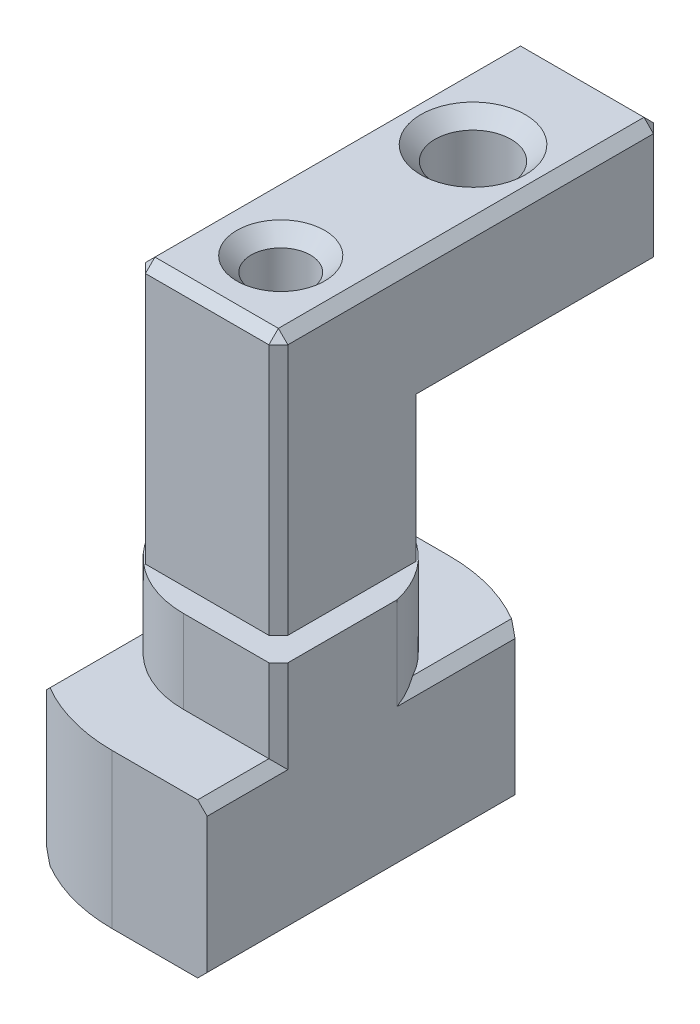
ISO-10303-21;
HEADER;
FILE_DESCRIPTION(('STEP AP214'),'2;1');
FILE_NAME('part.step','',(''),(''),'','','');
FILE_SCHEMA(('AUTOMOTIVE_DESIGN { 1 0 10303 214 1 1 1 1 }'));
ENDSEC;
DATA;
#1=APPLICATION_CONTEXT('core data for automotive mechanical design processes');
#2=APPLICATION_PROTOCOL_DEFINITION('international standard','automotive_design',2000,#1);
#3=PRODUCT_CONTEXT('',#1,'mechanical');
#4=PRODUCT('Part','Part','',(#3));
#5=PRODUCT_RELATED_PRODUCT_CATEGORY('part','',(#4));
#6=PRODUCT_DEFINITION_FORMATION('','',#4);
#7=PRODUCT_DEFINITION_CONTEXT('part definition',#1,'design');
#8=PRODUCT_DEFINITION('design','',#6,#7);
#9=PRODUCT_DEFINITION_SHAPE('','',#8);
#10=(LENGTH_UNIT() NAMED_UNIT(*) SI_UNIT(.MILLI.,.METRE.));
#11=(NAMED_UNIT(*) PLANE_ANGLE_UNIT() SI_UNIT($,.RADIAN.));
#12=(NAMED_UNIT(*) SI_UNIT($,.STERADIAN.) SOLID_ANGLE_UNIT());
#13=UNCERTAINTY_MEASURE_WITH_UNIT(LENGTH_MEASURE(1.E-05),#10,'distance_accuracy_value','');
#14=(GEOMETRIC_REPRESENTATION_CONTEXT(3) GLOBAL_UNCERTAINTY_ASSIGNED_CONTEXT((#13)) GLOBAL_UNIT_ASSIGNED_CONTEXT((#10,
#11,#12)) REPRESENTATION_CONTEXT('',''));
#15=CARTESIAN_POINT('',(0.,0.,0.));
#16=DIRECTION('',(0.,0.,1.));
#17=DIRECTION('',(1.,0.,0.));
#18=AXIS2_PLACEMENT_3D('',#15,#16,#17);
#19=CARTESIAN_POINT('',(0.,10.,0.));
#20=DIRECTION('',(0.,-1.,0.));
#21=DIRECTION('',(0.,0.,-1.));
#22=AXIS2_PLACEMENT_3D('',#19,#20,#21);
#23=PLANE('',#22);
#24=CARTESIAN_POINT('',(0.,10.,0.));
#25=DIRECTION('',(0.,1.,0.));
#26=DIRECTION('',(0.,0.,-1.));
#27=AXIS2_PLACEMENT_3D('',#24,#25,#26);
#28=CIRCLE('',#27,4.1);
#29=CARTESIAN_POINT('',(-4.,10.,0.900000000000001));
#30=VERTEX_POINT('',#29);
#31=CARTESIAN_POINT('',(0.,10.,4.1));
#32=VERTEX_POINT('',#31);
#33=EDGE_CURVE('E417',#30,#32,#28,.T.);
#34=ORIENTED_EDGE('',*,*,#33,.T.);
#35=DIRECTION('',(1.,0.,0.));
#36=VECTOR('',#35,1.);
#37=CARTESIAN_POINT('',(4.,10.,4.1));
#38=LINE('',#37,#36);
#39=CARTESIAN_POINT('',(3.60000000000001,10.,4.1));
#40=VERTEX_POINT('',#39);
#41=EDGE_CURVE('E420',#32,#40,#38,.T.);
#42=ORIENTED_EDGE('',*,*,#41,.T.);
#43=DIRECTION('',(-0.707106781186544,0.,0.707106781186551));
#44=VECTOR('',#43,1.);
#45=CARTESIAN_POINT('',(4.,10.,3.7));
#46=LINE('',#45,#44);
#47=CARTESIAN_POINT('',(4.,10.,3.7));
#48=VERTEX_POINT('',#47);
#49=EDGE_CURVE('E270',#40,#48,#46,.F.);
#50=ORIENTED_EDGE('',*,*,#49,.T.);
#51=DIRECTION('',(0.,0.,-1.));
#52=VECTOR('',#51,1.);
#53=CARTESIAN_POINT('',(4.,10.,-0.899999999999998));
#54=LINE('',#53,#52);
#55=CARTESIAN_POINT('',(4.,10.,-0.899999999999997));
#56=VERTEX_POINT('',#55);
#57=EDGE_CURVE('E424',#48,#56,#54,.T.);
#58=ORIENTED_EDGE('',*,*,#57,.T.);
#59=CARTESIAN_POINT('',(0.,10.,0.));
#60=DIRECTION('',(0.,1.,0.));
#61=DIRECTION('',(0.,0.,-1.));
#62=AXIS2_PLACEMENT_3D('',#59,#60,#61);
#63=CIRCLE('',#62,4.1);
#64=CARTESIAN_POINT('',(0.,10.,-4.1));
#65=VERTEX_POINT('',#64);
#66=EDGE_CURVE('E427',#56,#65,#63,.T.);
#67=ORIENTED_EDGE('',*,*,#66,.T.);
#68=DIRECTION('',(-1.,0.,0.));
#69=VECTOR('',#68,1.);
#70=CARTESIAN_POINT('',(-4.,10.,-4.1));
#71=LINE('',#70,#69);
#72=CARTESIAN_POINT('',(-3.60000000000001,10.,-4.1));
#73=VERTEX_POINT('',#72);
#74=EDGE_CURVE('E430',#65,#73,#71,.T.);
#75=ORIENTED_EDGE('',*,*,#74,.T.);
#76=DIRECTION('',(0.707106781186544,0.,-0.707106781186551));
#77=VECTOR('',#76,1.);
#78=CARTESIAN_POINT('',(-4.,10.,-3.7));
#79=LINE('',#78,#77);
#80=CARTESIAN_POINT('',(-4.,10.,-3.7));
#81=VERTEX_POINT('',#80);
#82=EDGE_CURVE('E279',#73,#81,#79,.F.);
#83=ORIENTED_EDGE('',*,*,#82,.T.);
#84=DIRECTION('',(0.,0.,1.));
#85=VECTOR('',#84,1.);
#86=CARTESIAN_POINT('',(-4.,10.,0.900000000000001));
#87=LINE('',#86,#85);
#88=EDGE_CURVE('E433',#81,#30,#87,.T.);
#89=ORIENTED_EDGE('',*,*,#88,.T.);
#90=EDGE_LOOP('',(#34,#42,#50,#58,#67,#75,#83,#89));
#91=FACE_BOUND('',#90,.T.);
#92=DIRECTION('',(1.,0.,0.));
#93=VECTOR('',#92,1.);
#94=CARTESIAN_POINT('',(3.,10.,3.1));
#95=LINE('',#94,#93);
#96=CARTESIAN_POINT('',(-2.6,10.,3.1));
#97=VERTEX_POINT('',#96);
#98=CARTESIAN_POINT('',(2.6,10.,3.1));
#99=VERTEX_POINT('',#98);
#100=EDGE_CURVE('E408',#97,#99,#95,.T.);
#101=ORIENTED_EDGE('',*,*,#100,.F.);
#102=DIRECTION('',(0.707106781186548,0.,0.707106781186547));
#103=VECTOR('',#102,1.);
#104=CARTESIAN_POINT('',(-2.85,10.,2.85));
#105=LINE('',#104,#103);
#106=CARTESIAN_POINT('',(-3.,10.,2.7));
#107=VERTEX_POINT('',#106);
#108=EDGE_CURVE('E287',#97,#107,#105,.F.);
#109=ORIENTED_EDGE('',*,*,#108,.T.);
#110=DIRECTION('',(0.,0.,1.));
#111=VECTOR('',#110,1.);
#112=CARTESIAN_POINT('',(-3.,10.,3.1));
#113=LINE('',#112,#111);
#114=CARTESIAN_POINT('',(-3.,10.,-2.7));
#115=VERTEX_POINT('',#114);
#116=EDGE_CURVE('E394',#115,#107,#113,.T.);
#117=ORIENTED_EDGE('',*,*,#116,.F.);
#118=DIRECTION('',(-0.707106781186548,0.,0.707106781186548));
#119=VECTOR('',#118,1.);
#120=CARTESIAN_POINT('',(-2.85,10.,-2.85));
#121=LINE('',#120,#119);
#122=CARTESIAN_POINT('',(-2.6,10.,-3.1));
#123=VERTEX_POINT('',#122);
#124=EDGE_CURVE('E291',#115,#123,#121,.F.);
#125=ORIENTED_EDGE('',*,*,#124,.T.);
#126=DIRECTION('',(-1.,0.,0.));
#127=VECTOR('',#126,1.);
#128=CARTESIAN_POINT('',(-3.,10.,-3.1));
#129=LINE('',#128,#127);
#130=CARTESIAN_POINT('',(2.6,10.,-3.1));
#131=VERTEX_POINT('',#130);
#132=EDGE_CURVE('E411',#131,#123,#129,.T.);
#133=ORIENTED_EDGE('',*,*,#132,.F.);
#134=DIRECTION('',(-0.707106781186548,0.,-0.707106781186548));
#135=VECTOR('',#134,1.);
#136=CARTESIAN_POINT('',(2.85,10.,-2.85));
#137=LINE('',#136,#135);
#138=CARTESIAN_POINT('',(3.,10.,-2.7));
#139=VERTEX_POINT('',#138);
#140=EDGE_CURVE('E69',#131,#139,#137,.F.);
#141=ORIENTED_EDGE('',*,*,#140,.T.);
#142=DIRECTION('',(0.,0.,-1.));
#143=VECTOR('',#142,1.);
#144=CARTESIAN_POINT('',(3.,10.,-3.1));
#145=LINE('',#144,#143);
#146=CARTESIAN_POINT('',(3.,10.,2.7));
#147=VERTEX_POINT('',#146);
#148=EDGE_CURVE('E398',#147,#139,#145,.T.);
#149=ORIENTED_EDGE('',*,*,#148,.F.);
#150=DIRECTION('',(0.707106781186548,0.,-0.707106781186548));
#151=VECTOR('',#150,1.);
#152=CARTESIAN_POINT('',(2.85,10.,2.85));
#153=LINE('',#152,#151);
#154=EDGE_CURVE('E289',#147,#99,#153,.F.);
#155=ORIENTED_EDGE('',*,*,#154,.T.);
#156=EDGE_LOOP('',(#101,#109,#117,#125,#133,#141,#149,#155));
#157=FACE_BOUND('',#156,.T.);
#158=ADVANCED_FACE('F37',(#91,#157),#23,.F.);
#159=CARTESIAN_POINT('',(0.,6.5,0.));
#160=DIRECTION('',(0.,1.,0.));
#161=DIRECTION('',(0.,0.,1.));
#162=AXIS2_PLACEMENT_3D('',#159,#160,#161);
#163=PLANE('',#162);
#164=CARTESIAN_POINT('',(0.,6.5,0.));
#165=DIRECTION('',(0.,1.,0.));
#166=DIRECTION('',(0.,0.,-1.));
#167=AXIS2_PLACEMENT_3D('',#164,#165,#166);
#168=CIRCLE('',#167,4.1);
#169=CARTESIAN_POINT('',(3.60000000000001,6.5,-1.96214168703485));
#170=VERTEX_POINT('',#169);
#171=CARTESIAN_POINT('',(0.,6.5,-4.1));
#172=VERTEX_POINT('',#171);
#173=EDGE_CURVE('E81',#170,#172,#168,.T.);
#174=ORIENTED_EDGE('',*,*,#173,.F.);
#175=DIRECTION('',(0.,0.,-1.));
#176=VECTOR('',#175,1.);
#177=CARTESIAN_POINT('',(3.60000000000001,6.5,-5.86600375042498));
#178=LINE('',#177,#176);
#179=CARTESIAN_POINT('',(3.60000000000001,6.5,-6.11964051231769));
#180=VERTEX_POINT('',#179);
#181=EDGE_CURVE('E561',#170,#180,#178,.T.);
#182=ORIENTED_EDGE('',*,*,#181,.T.);
#183=CARTESIAN_POINT('',(0.,6.5,0.));
#184=DIRECTION('',(0.,1.,0.));
#185=DIRECTION('',(0.,0.,1.));
#186=AXIS2_PLACEMENT_3D('',#183,#184,#185);
#187=CIRCLE('',#186,7.1);
#188=CARTESIAN_POINT('',(0.,6.5,-7.1));
#189=VERTEX_POINT('',#188);
#190=EDGE_CURVE('E460',#180,#189,#187,.T.);
#191=ORIENTED_EDGE('',*,*,#190,.T.);
#192=DIRECTION('',(-1.,0.,0.));
#193=VECTOR('',#192,1.);
#194=CARTESIAN_POINT('',(0.,6.5,-7.1));
#195=LINE('',#194,#193);
#196=CARTESIAN_POINT('',(-3.60000000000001,6.5,-7.1));
#197=VERTEX_POINT('',#196);
#198=EDGE_CURVE('E463',#189,#197,#195,.T.);
#199=ORIENTED_EDGE('',*,*,#198,.T.);
#200=DIRECTION('',(0.,0.,1.));
#201=VECTOR('',#200,1.);
#202=CARTESIAN_POINT('',(-3.60000000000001,6.5,-4.1));
#203=LINE('',#202,#201);
#204=CARTESIAN_POINT('',(-3.60000000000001,6.5,-4.1));
#205=VERTEX_POINT('',#204);
#206=EDGE_CURVE('E559',#197,#205,#203,.T.);
#207=ORIENTED_EDGE('',*,*,#206,.T.);
#208=DIRECTION('',(-1.,0.,0.));
#209=VECTOR('',#208,1.);
#210=CARTESIAN_POINT('',(-4.,6.5,-4.1));
#211=LINE('',#210,#209);
#212=EDGE_CURVE('E421',#172,#205,#211,.T.);
#213=ORIENTED_EDGE('',*,*,#212,.F.);
#214=EDGE_LOOP('',(#174,#182,#191,#199,#207,#213));
#215=FACE_BOUND('',#214,.T.);
#216=ADVANCED_FACE('F622',(#215),#163,.T.);
#217=CARTESIAN_POINT('',(0.,6.5,0.));
#218=DIRECTION('',(0.,-1.,0.));
#219=DIRECTION('',(0.,0.,-1.));
#220=AXIS2_PLACEMENT_3D('',#217,#218,#219);
#221=CYLINDRICAL_SURFACE('',#220,7.1);
#222=CARTESIAN_POINT('',(0.,6.5,0.));
#223=DIRECTION('',(0.,1.,0.));
#224=DIRECTION('',(0.,0.,1.));
#225=AXIS2_PLACEMENT_3D('',#222,#223,#224);
#226=CIRCLE('',#225,7.1);
#227=CARTESIAN_POINT('',(-3.6,6.5,6.11964051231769));
#228=VERTEX_POINT('',#227);
#229=CARTESIAN_POINT('',(0.,6.5,7.1));
#230=VERTEX_POINT('',#229);
#231=EDGE_CURVE('E453',#228,#230,#226,.T.);
#232=ORIENTED_EDGE('',*,*,#231,.F.);
#233=CARTESIAN_POINT('',(0.,10.1,0.));
#234=DIRECTION('',(-0.707106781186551,0.707106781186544,0.));
#235=DIRECTION('',(-0.707106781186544,-0.707106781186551,0.));
#236=AXIS2_PLACEMENT_3D('',#233,#234,#235);
#237=ELLIPSE('',#236,10.040916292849,7.1);
#238=CARTESIAN_POINT('',(-4.,6.1,5.86600375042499));
#239=VERTEX_POINT('',#238);
#240=EDGE_CURVE('E546',#228,#239,#237,.F.);
#241=ORIENTED_EDGE('',*,*,#240,.T.);
#242=DIRECTION('',(0.,-1.,0.));
#243=VECTOR('',#242,1.);
#244=CARTESIAN_POINT('',(-4.,6.5,5.86600375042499));
#245=LINE('',#244,#243);
#246=CARTESIAN_POINT('',(-4.,0.400000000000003,5.86600375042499));
#247=VERTEX_POINT('',#246);
#248=EDGE_CURVE('E466',#239,#247,#245,.T.);
#249=ORIENTED_EDGE('',*,*,#248,.T.);
#250=CARTESIAN_POINT('',(0.,-3.6,0.));
#251=DIRECTION('',(0.707106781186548,0.707106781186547,0.));
#252=DIRECTION('',(0.707106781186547,-0.707106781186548,0.));
#253=AXIS2_PLACEMENT_3D('',#250,#251,#252);
#254=ELLIPSE('',#253,10.040916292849,7.1);
#255=CARTESIAN_POINT('',(-3.6,0.,6.1196405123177));
#256=VERTEX_POINT('',#255);
#257=EDGE_CURVE('E544',#247,#256,#254,.T.);
#258=ORIENTED_EDGE('',*,*,#257,.T.);
#259=CARTESIAN_POINT('',(0.,0.,0.));
#260=DIRECTION('',(0.,1.,0.));
#261=DIRECTION('',(0.,0.,1.));
#262=AXIS2_PLACEMENT_3D('',#259,#260,#261);
#263=CIRCLE('',#262,7.1);
#264=CARTESIAN_POINT('',(0.,0.,7.1));
#265=VERTEX_POINT('',#264);
#266=EDGE_CURVE('E263',#256,#265,#263,.T.);
#267=ORIENTED_EDGE('',*,*,#266,.T.);
#268=DIRECTION('',(0.,-1.,0.));
#269=VECTOR('',#268,1.);
#270=CARTESIAN_POINT('',(0.,6.5,7.1));
#271=LINE('',#270,#269);
#272=EDGE_CURVE('E262',#230,#265,#271,.T.);
#273=ORIENTED_EDGE('',*,*,#272,.F.);
#274=EDGE_LOOP('',(#232,#241,#249,#258,#267,#273));
#275=FACE_BOUND('',#274,.T.);
#276=ADVANCED_FACE('F672',(#275),#221,.T.);
#277=CARTESIAN_POINT('',(0.,6.5,7.1));
#278=DIRECTION('',(0.,0.,-1.));
#279=DIRECTION('',(-1.,0.,0.));
#280=AXIS2_PLACEMENT_3D('',#277,#278,#279);
#281=PLANE('',#280);
#282=DIRECTION('',(0.,-1.,0.));
#283=VECTOR('',#282,1.);
#284=CARTESIAN_POINT('',(4.,6.5,7.1));
#285=LINE('',#284,#283);
#286=CARTESIAN_POINT('',(4.,6.1,7.1));
#287=VERTEX_POINT('',#286);
#288=CARTESIAN_POINT('',(4.,0.400000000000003,7.1));
#289=VERTEX_POINT('',#288);
#290=EDGE_CURVE('E482',#287,#289,#285,.T.);
#291=ORIENTED_EDGE('',*,*,#290,.F.);
#292=DIRECTION('',(-0.707106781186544,0.707106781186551,0.));
#293=VECTOR('',#292,1.);
#294=CARTESIAN_POINT('',(3.60000000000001,6.5,7.1));
#295=LINE('',#294,#293);
#296=CARTESIAN_POINT('',(3.60000000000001,6.5,7.1));
#297=VERTEX_POINT('',#296);
#298=EDGE_CURVE('E269',#287,#297,#295,.T.);
#299=ORIENTED_EDGE('',*,*,#298,.T.);
#300=DIRECTION('',(1.,0.,0.));
#301=VECTOR('',#300,1.);
#302=CARTESIAN_POINT('',(0.,6.5,7.1));
#303=LINE('',#302,#301);
#304=EDGE_CURVE('E456',#230,#297,#303,.T.);
#305=ORIENTED_EDGE('',*,*,#304,.F.);
#306=ORIENTED_EDGE('',*,*,#272,.T.);
#307=DIRECTION('',(1.,0.,0.));
#308=VECTOR('',#307,1.);
#309=CARTESIAN_POINT('',(0.,0.,7.1));
#310=LINE('',#309,#308);
#311=CARTESIAN_POINT('',(3.6,0.,7.1));
#312=VERTEX_POINT('',#311);
#313=EDGE_CURVE('E248',#265,#312,#310,.T.);
#314=ORIENTED_EDGE('',*,*,#313,.T.);
#315=DIRECTION('',(-0.707106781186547,-0.707106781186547,0.));
#316=VECTOR('',#315,1.);
#317=CARTESIAN_POINT('',(4.,0.400000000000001,7.1));
#318=LINE('',#317,#316);
#319=EDGE_CURVE('E258',#312,#289,#318,.F.);
#320=ORIENTED_EDGE('',*,*,#319,.T.);
#321=EDGE_LOOP('',(#291,#299,#305,#306,#314,#320));
#322=FACE_BOUND('',#321,.T.);
#323=ADVANCED_FACE('F257',(#322),#281,.F.);
#324=CARTESIAN_POINT('',(4.,6.5,7.1));
#325=DIRECTION('',(-1.,0.,0.));
#326=DIRECTION('',(0.,0.,1.));
#327=AXIS2_PLACEMENT_3D('',#324,#325,#326);
#328=PLANE('',#327);
#329=DIRECTION('',(0.,-1.,0.));
#330=VECTOR('',#329,1.);
#331=CARTESIAN_POINT('',(4.,6.5,-5.86600375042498));
#332=LINE('',#331,#330);
#333=CARTESIAN_POINT('',(4.,6.1,-5.86600375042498));
#334=VERTEX_POINT('',#333);
#335=CARTESIAN_POINT('',(4.,0.400000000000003,-5.86600375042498));
#336=VERTEX_POINT('',#335);
#337=EDGE_CURVE('E479',#334,#336,#332,.T.);
#338=ORIENTED_EDGE('',*,*,#337,.F.);
#339=DIRECTION('',(0.,0.,1.));
#340=VECTOR('',#339,1.);
#341=CARTESIAN_POINT('',(4.,6.1,-0.899999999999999));
#342=LINE('',#341,#340);
#343=CARTESIAN_POINT('',(4.,6.1,-0.899999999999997));
#344=VERTEX_POINT('',#343);
#345=EDGE_CURVE('E574',#334,#344,#342,.T.);
#346=ORIENTED_EDGE('',*,*,#345,.T.);
#347=DIRECTION('',(0.,-1.,0.));
#348=VECTOR('',#347,1.);
#349=CARTESIAN_POINT('',(4.,10.,-0.899999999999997));
#350=LINE('',#349,#348);
#351=EDGE_CURVE('E448',#56,#344,#350,.T.);
#352=ORIENTED_EDGE('',*,*,#351,.F.);
#353=ORIENTED_EDGE('',*,*,#57,.F.);
#354=DIRECTION('',(0.,-1.,0.));
#355=VECTOR('',#354,1.);
#356=CARTESIAN_POINT('',(4.,6.5,3.7));
#357=LINE('',#356,#355);
#358=CARTESIAN_POINT('',(4.,6.1,3.7));
#359=VERTEX_POINT('',#358);
#360=EDGE_CURVE('E571',#48,#359,#357,.T.);
#361=ORIENTED_EDGE('',*,*,#360,.T.);
#362=DIRECTION('',(0.,0.,1.));
#363=VECTOR('',#362,1.);
#364=CARTESIAN_POINT('',(4.,6.1,7.1));
#365=LINE('',#364,#363);
#366=EDGE_CURVE('E569',#359,#287,#365,.T.);
#367=ORIENTED_EDGE('',*,*,#366,.T.);
#368=ORIENTED_EDGE('',*,*,#290,.T.);
#369=DIRECTION('',(0.,0.,-1.));
#370=VECTOR('',#369,1.);
#371=CARTESIAN_POINT('',(4.,0.400000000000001,7.1));
#372=LINE('',#371,#370);
#373=EDGE_CURVE('E268',#289,#336,#372,.T.);
#374=ORIENTED_EDGE('',*,*,#373,.T.);
#375=EDGE_LOOP('',(#338,#346,#352,#353,#361,#367,#368,#374));
#376=FACE_BOUND('',#375,.T.);
#377=ADVANCED_FACE('F595',(#376),#328,.F.);
#378=CARTESIAN_POINT('',(0.,6.5,0.));
#379=DIRECTION('',(0.,-1.,0.));
#380=DIRECTION('',(0.,0.,-1.));
#381=AXIS2_PLACEMENT_3D('',#378,#379,#380);
#382=CYLINDRICAL_SURFACE('',#381,7.1);
#383=ORIENTED_EDGE('',*,*,#190,.F.);
#384=CARTESIAN_POINT('',(0.,10.1,0.));
#385=DIRECTION('',(0.707106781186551,0.707106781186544,0.));
#386=DIRECTION('',(0.707106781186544,-0.707106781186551,0.));
#387=AXIS2_PLACEMENT_3D('',#384,#385,#386);
#388=ELLIPSE('',#387,10.040916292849,7.1);
#389=EDGE_CURVE('E566',#180,#334,#388,.F.);
#390=ORIENTED_EDGE('',*,*,#389,.T.);
#391=ORIENTED_EDGE('',*,*,#337,.T.);
#392=CARTESIAN_POINT('',(0.,-3.6,0.));
#393=DIRECTION('',(-0.707106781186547,0.707106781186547,0.));
#394=DIRECTION('',(-0.707106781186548,-0.707106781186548,0.));
#395=AXIS2_PLACEMENT_3D('',#392,#393,#394);
#396=ELLIPSE('',#395,10.040916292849,7.1);
#397=CARTESIAN_POINT('',(3.6,0.,-6.1196405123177));
#398=VERTEX_POINT('',#397);
#399=EDGE_CURVE('E564',#336,#398,#396,.T.);
#400=ORIENTED_EDGE('',*,*,#399,.T.);
#401=CARTESIAN_POINT('',(0.,0.,0.));
#402=DIRECTION('',(0.,1.,0.));
#403=DIRECTION('',(0.,0.,1.));
#404=AXIS2_PLACEMENT_3D('',#401,#402,#403);
#405=CIRCLE('',#404,7.1);
#406=CARTESIAN_POINT('',(0.,0.,-7.1));
#407=VERTEX_POINT('',#406);
#408=EDGE_CURVE('E251',#398,#407,#405,.T.);
#409=ORIENTED_EDGE('',*,*,#408,.T.);
#410=DIRECTION('',(0.,-1.,0.));
#411=VECTOR('',#410,1.);
#412=CARTESIAN_POINT('',(0.,6.5,-7.1));
#413=LINE('',#412,#411);
#414=EDGE_CURVE('E476',#189,#407,#413,.T.);
#415=ORIENTED_EDGE('',*,*,#414,.F.);
#416=EDGE_LOOP('',(#383,#390,#391,#400,#409,#415));
#417=FACE_BOUND('',#416,.T.);
#418=ADVANCED_FACE('F613',(#417),#382,.T.);
#419=CARTESIAN_POINT('',(0.,6.5,-7.1));
#420=DIRECTION('',(0.,0.,1.));
#421=DIRECTION('',(1.,0.,0.));
#422=AXIS2_PLACEMENT_3D('',#419,#420,#421);
#423=PLANE('',#422);
#424=DIRECTION('',(0.,-1.,0.));
#425=VECTOR('',#424,1.);
#426=CARTESIAN_POINT('',(-4.,6.5,-7.1));
#427=LINE('',#426,#425);
#428=CARTESIAN_POINT('',(-4.,6.1,-7.1));
#429=VERTEX_POINT('',#428);
#430=CARTESIAN_POINT('',(-4.,0.400000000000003,-7.1));
#431=VERTEX_POINT('',#430);
#432=EDGE_CURVE('E473',#429,#431,#427,.T.);
#433=ORIENTED_EDGE('',*,*,#432,.F.);
#434=DIRECTION('',(0.707106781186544,0.707106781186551,0.));
#435=VECTOR('',#434,1.);
#436=CARTESIAN_POINT('',(-3.60000000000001,6.5,-7.1));
#437=LINE('',#436,#435);
#438=EDGE_CURVE('E283',#429,#197,#437,.T.);
#439=ORIENTED_EDGE('',*,*,#438,.T.);
#440=ORIENTED_EDGE('',*,*,#198,.F.);
#441=ORIENTED_EDGE('',*,*,#414,.T.);
#442=DIRECTION('',(-1.,0.,0.));
#443=VECTOR('',#442,1.);
#444=CARTESIAN_POINT('',(0.,0.,-7.1));
#445=LINE('',#444,#443);
#446=CARTESIAN_POINT('',(-3.6,0.,-7.1));
#447=VERTEX_POINT('',#446);
#448=EDGE_CURVE('E457',#407,#447,#445,.T.);
#449=ORIENTED_EDGE('',*,*,#448,.T.);
#450=DIRECTION('',(0.707106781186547,-0.707106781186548,0.));
#451=VECTOR('',#450,1.);
#452=CARTESIAN_POINT('',(-4.,0.400000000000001,-7.1));
#453=LINE('',#452,#451);
#454=EDGE_CURVE('E281',#447,#431,#453,.F.);
#455=ORIENTED_EDGE('',*,*,#454,.T.);
#456=EDGE_LOOP('',(#433,#439,#440,#441,#449,#455));
#457=FACE_BOUND('',#456,.T.);
#458=ADVANCED_FACE('F617',(#457),#423,.F.);
#459=CARTESIAN_POINT('',(-4.,6.5,-7.1));
#460=DIRECTION('',(1.,0.,0.));
#461=DIRECTION('',(0.,0.,-1.));
#462=AXIS2_PLACEMENT_3D('',#459,#460,#461);
#463=PLANE('',#462);
#464=ORIENTED_EDGE('',*,*,#248,.F.);
#465=DIRECTION('',(0.,0.,-1.));
#466=VECTOR('',#465,1.);
#467=CARTESIAN_POINT('',(-4.,6.1,0.900000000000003));
#468=LINE('',#467,#466);
#469=CARTESIAN_POINT('',(-4.,6.1,0.900000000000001));
#470=VERTEX_POINT('',#469);
#471=EDGE_CURVE('E556',#239,#470,#468,.T.);
#472=ORIENTED_EDGE('',*,*,#471,.T.);
#473=DIRECTION('',(0.,-1.,0.));
#474=VECTOR('',#473,1.);
#475=CARTESIAN_POINT('',(-4.,10.,0.900000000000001));
#476=LINE('',#475,#474);
#477=EDGE_CURVE('E436',#30,#470,#476,.T.);
#478=ORIENTED_EDGE('',*,*,#477,.F.);
#479=ORIENTED_EDGE('',*,*,#88,.F.);
#480=DIRECTION('',(0.,-1.,0.));
#481=VECTOR('',#480,1.);
#482=CARTESIAN_POINT('',(-4.,6.5,-3.7));
#483=LINE('',#482,#481);
#484=CARTESIAN_POINT('',(-4.,6.1,-3.7));
#485=VERTEX_POINT('',#484);
#486=EDGE_CURVE('E553',#81,#485,#483,.T.);
#487=ORIENTED_EDGE('',*,*,#486,.T.);
#488=DIRECTION('',(0.,0.,-1.));
#489=VECTOR('',#488,1.);
#490=CARTESIAN_POINT('',(-4.,6.1,-7.1));
#491=LINE('',#490,#489);
#492=EDGE_CURVE('E551',#485,#429,#491,.T.);
#493=ORIENTED_EDGE('',*,*,#492,.T.);
#494=ORIENTED_EDGE('',*,*,#432,.T.);
#495=DIRECTION('',(0.,0.,1.));
#496=VECTOR('',#495,1.);
#497=CARTESIAN_POINT('',(-4.,0.400000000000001,-7.1));
#498=LINE('',#497,#496);
#499=EDGE_CURVE('E548',#431,#247,#498,.T.);
#500=ORIENTED_EDGE('',*,*,#499,.T.);
#501=EDGE_LOOP('',(#464,#472,#478,#479,#487,#493,#494,#500));
#502=FACE_BOUND('',#501,.T.);
#503=ADVANCED_FACE('F639',(#502),#463,.F.);
#504=CARTESIAN_POINT('',(0.,6.5,0.));
#505=DIRECTION('',(0.,1.,0.));
#506=DIRECTION('',(0.,0.,-1.));
#507=AXIS2_PLACEMENT_3D('',#504,#505,#506);
#508=CIRCLE('',#507,4.1);
#509=CARTESIAN_POINT('',(-3.6,6.5,1.96214168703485));
#510=VERTEX_POINT('',#509);
#511=CARTESIAN_POINT('',(0.,6.5,4.1));
#512=VERTEX_POINT('',#511);
#513=EDGE_CURVE('E406',#510,#512,#508,.T.);
#514=ORIENTED_EDGE('',*,*,#513,.F.);
#515=DIRECTION('',(0.,0.,1.));
#516=VECTOR('',#515,1.);
#517=CARTESIAN_POINT('',(-3.6,6.5,5.86600375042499));
#518=LINE('',#517,#516);
#519=EDGE_CURVE('E541',#510,#228,#518,.T.);
#520=ORIENTED_EDGE('',*,*,#519,.T.);
#521=ORIENTED_EDGE('',*,*,#231,.T.);
#522=ORIENTED_EDGE('',*,*,#304,.T.);
#523=DIRECTION('',(0.,0.,-1.));
#524=VECTOR('',#523,1.);
#525=CARTESIAN_POINT('',(3.60000000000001,6.5,4.1));
#526=LINE('',#525,#524);
#527=CARTESIAN_POINT('',(3.60000000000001,6.5,4.1));
#528=VERTEX_POINT('',#527);
#529=EDGE_CURVE('E539',#297,#528,#526,.T.);
#530=ORIENTED_EDGE('',*,*,#529,.T.);
#531=DIRECTION('',(1.,0.,0.));
#532=VECTOR('',#531,1.);
#533=CARTESIAN_POINT('',(4.,6.5,4.1));
#534=LINE('',#533,#532);
#535=EDGE_CURVE('E438',#512,#528,#534,.T.);
#536=ORIENTED_EDGE('',*,*,#535,.F.);
#537=EDGE_LOOP('',(#514,#520,#521,#522,#530,#536));
#538=FACE_BOUND('',#537,.T.);
#539=ADVANCED_FACE('F647',(#538),#163,.T.);
#540=CARTESIAN_POINT('',(0.,0.,0.));
#541=DIRECTION('',(0.,1.,0.));
#542=DIRECTION('',(0.,0.,1.));
#543=AXIS2_PLACEMENT_3D('',#540,#541,#542);
#544=PLANE('',#543);
#545=CARTESIAN_POINT('',(0.,0.,0.));
#546=DIRECTION('',(0.,1.,0.));
#547=DIRECTION('',(0.,0.,1.));
#548=AXIS2_PLACEMENT_3D('',#545,#546,#547);
#549=CIRCLE('',#548,2.5);
#550=CARTESIAN_POINT('',(0.,0.,2.5));
#551=VERTEX_POINT('',#550);
#552=EDGE_CURVE('E364',#551,#551,#549,.T.);
#553=ORIENTED_EDGE('',*,*,#552,.T.);
#554=EDGE_LOOP('',(#553));
#555=FACE_BOUND('',#554,.T.);
#556=ORIENTED_EDGE('',*,*,#408,.F.);
#557=DIRECTION('',(0.,0.,1.));
#558=VECTOR('',#557,1.);
#559=CARTESIAN_POINT('',(3.6,0.,0.));
#560=LINE('',#559,#558);
#561=EDGE_CURVE('E244',#398,#312,#560,.T.);
#562=ORIENTED_EDGE('',*,*,#561,.T.);
#563=ORIENTED_EDGE('',*,*,#313,.F.);
#564=ORIENTED_EDGE('',*,*,#266,.F.);
#565=DIRECTION('',(0.,0.,-1.));
#566=VECTOR('',#565,1.);
#567=CARTESIAN_POINT('',(-3.6,0.,0.));
#568=LINE('',#567,#566);
#569=EDGE_CURVE('E55',#256,#447,#568,.T.);
#570=ORIENTED_EDGE('',*,*,#569,.T.);
#571=ORIENTED_EDGE('',*,*,#448,.F.);
#572=EDGE_LOOP('',(#556,#562,#563,#564,#570,#571));
#573=FACE_BOUND('',#572,.T.);
#574=ADVANCED_FACE('F246',(#555,#573),#544,.F.);
#575=CARTESIAN_POINT('',(0.,10.,0.));
#576=DIRECTION('',(0.,-1.,0.));
#577=DIRECTION('',(0.,0.,-1.));
#578=AXIS2_PLACEMENT_3D('',#575,#576,#577);
#579=CYLINDRICAL_SURFACE('',#578,4.1);
#580=ORIENTED_EDGE('',*,*,#477,.T.);
#581=CARTESIAN_POINT('',(0.,10.1,0.));
#582=DIRECTION('',(-0.707106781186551,0.707106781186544,0.));
#583=DIRECTION('',(-0.707106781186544,-0.707106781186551,0.));
#584=AXIS2_PLACEMENT_3D('',#581,#582,#583);
#585=ELLIPSE('',#584,5.79827560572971,4.1);
#586=EDGE_CURVE('E293',#470,#510,#585,.T.);
#587=ORIENTED_EDGE('',*,*,#586,.T.);
#588=ORIENTED_EDGE('',*,*,#513,.T.);
#589=DIRECTION('',(0.,-1.,0.));
#590=VECTOR('',#589,1.);
#591=CARTESIAN_POINT('',(0.,10.,4.1));
#592=LINE('',#591,#590);
#593=EDGE_CURVE('E450',#32,#512,#592,.T.);
#594=ORIENTED_EDGE('',*,*,#593,.F.);
#595=ORIENTED_EDGE('',*,*,#33,.F.);
#596=EDGE_LOOP('',(#580,#587,#588,#594,#595));
#597=FACE_BOUND('',#596,.T.);
#598=ADVANCED_FACE('F643',(#597),#579,.T.);
#599=CARTESIAN_POINT('',(4.,10.,4.1));
#600=DIRECTION('',(0.,0.,-1.));
#601=DIRECTION('',(-1.,0.,0.));
#602=AXIS2_PLACEMENT_3D('',#599,#600,#601);
#603=PLANE('',#602);
#604=ORIENTED_EDGE('',*,*,#535,.T.);
#605=DIRECTION('',(0.,1.,0.));
#606=VECTOR('',#605,1.);
#607=CARTESIAN_POINT('',(3.60000000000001,10.,4.1));
#608=LINE('',#607,#606);
#609=EDGE_CURVE('E274',#528,#40,#608,.T.);
#610=ORIENTED_EDGE('',*,*,#609,.T.);
#611=ORIENTED_EDGE('',*,*,#41,.F.);
#612=ORIENTED_EDGE('',*,*,#593,.T.);
#613=EDGE_LOOP('',(#604,#610,#611,#612));
#614=FACE_BOUND('',#613,.T.);
#615=ADVANCED_FACE('F579',(#614),#603,.F.);
#616=CARTESIAN_POINT('',(0.,10.,0.));
#617=DIRECTION('',(0.,-1.,0.));
#618=DIRECTION('',(0.,0.,-1.));
#619=AXIS2_PLACEMENT_3D('',#616,#617,#618);
#620=CYLINDRICAL_SURFACE('',#619,4.1);
#621=ORIENTED_EDGE('',*,*,#351,.T.);
#622=CARTESIAN_POINT('',(0.,10.1,0.));
#623=DIRECTION('',(0.707106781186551,0.707106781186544,0.));
#624=DIRECTION('',(0.707106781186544,-0.707106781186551,0.));
#625=AXIS2_PLACEMENT_3D('',#622,#623,#624);
#626=ELLIPSE('',#625,5.79827560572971,4.1);
#627=EDGE_CURVE('E295',#344,#170,#626,.T.);
#628=ORIENTED_EDGE('',*,*,#627,.T.);
#629=ORIENTED_EDGE('',*,*,#173,.T.);
#630=DIRECTION('',(0.,-1.,0.));
#631=VECTOR('',#630,1.);
#632=CARTESIAN_POINT('',(0.,10.,-4.1));
#633=LINE('',#632,#631);
#634=EDGE_CURVE('E445',#65,#172,#633,.T.);
#635=ORIENTED_EDGE('',*,*,#634,.F.);
#636=ORIENTED_EDGE('',*,*,#66,.F.);
#637=EDGE_LOOP('',(#621,#628,#629,#635,#636));
#638=FACE_BOUND('',#637,.T.);
#639=ADVANCED_FACE('F657',(#638),#620,.T.);
#640=CARTESIAN_POINT('',(-4.,10.,-4.1));
#641=DIRECTION('',(0.,0.,1.));
#642=DIRECTION('',(1.,0.,0.));
#643=AXIS2_PLACEMENT_3D('',#640,#641,#642);
#644=PLANE('',#643);
#645=ORIENTED_EDGE('',*,*,#212,.T.);
#646=DIRECTION('',(0.,1.,0.));
#647=VECTOR('',#646,1.);
#648=CARTESIAN_POINT('',(-3.60000000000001,10.,-4.1));
#649=LINE('',#648,#647);
#650=EDGE_CURVE('E272',#205,#73,#649,.T.);
#651=ORIENTED_EDGE('',*,*,#650,.T.);
#652=ORIENTED_EDGE('',*,*,#74,.F.);
#653=ORIENTED_EDGE('',*,*,#634,.T.);
#654=EDGE_LOOP('',(#645,#651,#652,#653));
#655=FACE_BOUND('',#654,.T.);
#656=ADVANCED_FACE('F634',(#655),#644,.F.);
#657=CARTESIAN_POINT('',(-3.,15.7,3.1));
#658=DIRECTION('',(1.,0.,0.));
#659=DIRECTION('',(0.,0.,-1.));
#660=AXIS2_PLACEMENT_3D('',#657,#658,#659);
#661=PLANE('',#660);
#662=ORIENTED_EDGE('',*,*,#116,.T.);
#663=DIRECTION('',(0.,1.,0.));
#664=VECTOR('',#663,1.);
#665=CARTESIAN_POINT('',(-3.,15.7,2.7));
#666=LINE('',#665,#664);
#667=CARTESIAN_POINT('',(-3.,20.6,2.7));
#668=VERTEX_POINT('',#667);
#669=EDGE_CURVE('E512',#107,#668,#666,.T.);
#670=ORIENTED_EDGE('',*,*,#669,.T.);
#671=DIRECTION('',(0.,0.,-1.));
#672=VECTOR('',#671,1.);
#673=CARTESIAN_POINT('',(-3.,20.6,3.1));
#674=LINE('',#673,#672);
#675=CARTESIAN_POINT('',(-3.,20.6,-12.7));
#676=VERTEX_POINT('',#675);
#677=EDGE_CURVE('E510',#668,#676,#674,.T.);
#678=ORIENTED_EDGE('',*,*,#677,.T.);
#679=DIRECTION('',(0.,-1.,0.));
#680=VECTOR('',#679,1.);
#681=CARTESIAN_POINT('',(-3.,15.7,-12.7));
#682=LINE('',#681,#680);
#683=CARTESIAN_POINT('',(-3.,16.1,-12.7));
#684=VERTEX_POINT('',#683);
#685=EDGE_CURVE('E508',#676,#684,#682,.T.);
#686=ORIENTED_EDGE('',*,*,#685,.T.);
#687=DIRECTION('',(0.,0.,1.));
#688=VECTOR('',#687,1.);
#689=CARTESIAN_POINT('',(-3.,16.1,-3.1));
#690=LINE('',#689,#688);
#691=CARTESIAN_POINT('',(-3.,16.1,-2.7));
#692=VERTEX_POINT('',#691);
#693=EDGE_CURVE('E506',#684,#692,#690,.T.);
#694=ORIENTED_EDGE('',*,*,#693,.T.);
#695=DIRECTION('',(0.,-1.,0.));
#696=VECTOR('',#695,1.);
#697=CARTESIAN_POINT('',(-3.,15.7,-2.7));
#698=LINE('',#697,#696);
#699=EDGE_CURVE('E504',#692,#115,#698,.T.);
#700=ORIENTED_EDGE('',*,*,#699,.T.);
#701=EDGE_LOOP('',(#662,#670,#678,#686,#694,#700));
#702=FACE_BOUND('',#701,.T.);
#703=ADVANCED_FACE('F664',(#702),#661,.F.);
#704=CARTESIAN_POINT('',(3.,15.7,3.1));
#705=DIRECTION('',(0.,0.,-1.));
#706=DIRECTION('',(-1.,0.,0.));
#707=AXIS2_PLACEMENT_3D('',#704,#705,#706);
#708=PLANE('',#707);
#709=DIRECTION('',(-1.,0.,0.));
#710=VECTOR('',#709,1.);
#711=CARTESIAN_POINT('',(3.,20.6,3.1));
#712=LINE('',#711,#710);
#713=CARTESIAN_POINT('',(2.6,20.6,3.1));
#714=VERTEX_POINT('',#713);
#715=CARTESIAN_POINT('',(-2.6,20.6,3.1));
#716=VERTEX_POINT('',#715);
#717=EDGE_CURVE('E534',#714,#716,#712,.T.);
#718=ORIENTED_EDGE('',*,*,#717,.T.);
#719=DIRECTION('',(0.,-1.,0.));
#720=VECTOR('',#719,1.);
#721=CARTESIAN_POINT('',(-2.6,15.7,3.1));
#722=LINE('',#721,#720);
#723=EDGE_CURVE('E536',#716,#97,#722,.T.);
#724=ORIENTED_EDGE('',*,*,#723,.T.);
#725=ORIENTED_EDGE('',*,*,#100,.T.);
#726=DIRECTION('',(0.,1.,0.));
#727=VECTOR('',#726,1.);
#728=CARTESIAN_POINT('',(2.6,15.7,3.1));
#729=LINE('',#728,#727);
#730=EDGE_CURVE('E532',#99,#714,#729,.T.);
#731=ORIENTED_EDGE('',*,*,#730,.T.);
#732=EDGE_LOOP('',(#718,#724,#725,#731));
#733=FACE_BOUND('',#732,.T.);
#734=ADVANCED_FACE('F677',(#733),#708,.F.);
#735=CARTESIAN_POINT('',(3.,15.7,-3.1));
#736=DIRECTION('',(-1.,0.,0.));
#737=DIRECTION('',(0.,0.,1.));
#738=AXIS2_PLACEMENT_3D('',#735,#736,#737);
#739=PLANE('',#738);
#740=ORIENTED_EDGE('',*,*,#148,.T.);
#741=DIRECTION('',(0.,1.,0.));
#742=VECTOR('',#741,1.);
#743=CARTESIAN_POINT('',(3.,15.7,-2.7));
#744=LINE('',#743,#742);
#745=CARTESIAN_POINT('',(3.,16.1,-2.7));
#746=VERTEX_POINT('',#745);
#747=EDGE_CURVE('E496',#139,#746,#744,.T.);
#748=ORIENTED_EDGE('',*,*,#747,.T.);
#749=DIRECTION('',(0.,0.,-1.));
#750=VECTOR('',#749,1.);
#751=CARTESIAN_POINT('',(3.,16.1,-13.1));
#752=LINE('',#751,#750);
#753=CARTESIAN_POINT('',(3.,16.1,-12.7));
#754=VERTEX_POINT('',#753);
#755=EDGE_CURVE('E494',#746,#754,#752,.T.);
#756=ORIENTED_EDGE('',*,*,#755,.T.);
#757=DIRECTION('',(0.,1.,0.));
#758=VECTOR('',#757,1.);
#759=CARTESIAN_POINT('',(3.,15.7,-12.7));
#760=LINE('',#759,#758);
#761=CARTESIAN_POINT('',(3.,20.6,-12.7));
#762=VERTEX_POINT('',#761);
#763=EDGE_CURVE('E488',#754,#762,#760,.T.);
#764=ORIENTED_EDGE('',*,*,#763,.T.);
#765=DIRECTION('',(0.,0.,1.));
#766=VECTOR('',#765,1.);
#767=CARTESIAN_POINT('',(3.,20.6,-3.1));
#768=LINE('',#767,#766);
#769=CARTESIAN_POINT('',(3.,20.6,2.7));
#770=VERTEX_POINT('',#769);
#771=EDGE_CURVE('E490',#762,#770,#768,.T.);
#772=ORIENTED_EDGE('',*,*,#771,.T.);
#773=DIRECTION('',(0.,-1.,0.));
#774=VECTOR('',#773,1.);
#775=CARTESIAN_POINT('',(3.,15.7,2.7));
#776=LINE('',#775,#774);
#777=EDGE_CURVE('E492',#770,#147,#776,.T.);
#778=ORIENTED_EDGE('',*,*,#777,.T.);
#779=EDGE_LOOP('',(#740,#748,#756,#764,#772,#778));
#780=FACE_BOUND('',#779,.T.);
#781=ADVANCED_FACE('F681',(#780),#739,.F.);
#782=CARTESIAN_POINT('',(-3.,15.7,-3.1));
#783=DIRECTION('',(0.,0.,1.));
#784=DIRECTION('',(1.,0.,0.));
#785=AXIS2_PLACEMENT_3D('',#782,#783,#784);
#786=PLANE('',#785);
#787=DIRECTION('',(-1.,0.,0.));
#788=VECTOR('',#787,1.);
#789=CARTESIAN_POINT('',(-3.,15.7,-3.1));
#790=LINE('',#789,#788);
#791=CARTESIAN_POINT('',(2.6,15.7,-3.1));
#792=VERTEX_POINT('',#791);
#793=CARTESIAN_POINT('',(-2.6,15.7,-3.1));
#794=VERTEX_POINT('',#793);
#795=EDGE_CURVE('E404',#792,#794,#790,.T.);
#796=ORIENTED_EDGE('',*,*,#795,.F.);
#797=DIRECTION('',(0.,-1.,0.));
#798=VECTOR('',#797,1.);
#799=CARTESIAN_POINT('',(2.6,15.7,-3.1));
#800=LINE('',#799,#798);
#801=EDGE_CURVE('E486',#792,#131,#800,.T.);
#802=ORIENTED_EDGE('',*,*,#801,.T.);
#803=ORIENTED_EDGE('',*,*,#132,.T.);
#804=DIRECTION('',(0.,1.,0.));
#805=VECTOR('',#804,1.);
#806=CARTESIAN_POINT('',(-2.6,15.7,-3.1));
#807=LINE('',#806,#805);
#808=EDGE_CURVE('E416',#123,#794,#807,.T.);
#809=ORIENTED_EDGE('',*,*,#808,.T.);
#810=EDGE_LOOP('',(#796,#802,#803,#809));
#811=FACE_BOUND('',#810,.T.);
#812=ADVANCED_FACE('F685',(#811),#786,.F.);
#813=CARTESIAN_POINT('',(-3.,21.,-13.1));
#814=DIRECTION('',(0.,0.,1.));
#815=DIRECTION('',(1.,0.,0.));
#816=AXIS2_PLACEMENT_3D('',#813,#814,#815);
#817=PLANE('',#816);
#818=DIRECTION('',(-1.,0.,0.));
#819=VECTOR('',#818,1.);
#820=CARTESIAN_POINT('',(-3.,16.1,-13.1));
#821=LINE('',#820,#819);
#822=CARTESIAN_POINT('',(2.6,16.1,-13.1));
#823=VERTEX_POINT('',#822);
#824=CARTESIAN_POINT('',(-2.6,16.1,-13.1));
#825=VERTEX_POINT('',#824);
#826=EDGE_CURVE('E514',#823,#825,#821,.T.);
#827=ORIENTED_EDGE('',*,*,#826,.T.);
#828=DIRECTION('',(0.,1.,0.));
#829=VECTOR('',#828,1.);
#830=CARTESIAN_POINT('',(-2.6,21.,-13.1));
#831=LINE('',#830,#829);
#832=CARTESIAN_POINT('',(-2.6,20.6,-13.1));
#833=VERTEX_POINT('',#832);
#834=EDGE_CURVE('E520',#825,#833,#831,.T.);
#835=ORIENTED_EDGE('',*,*,#834,.T.);
#836=DIRECTION('',(1.,0.,0.));
#837=VECTOR('',#836,1.);
#838=CARTESIAN_POINT('',(-3.,20.6,-13.1));
#839=LINE('',#838,#837);
#840=CARTESIAN_POINT('',(2.6,20.6,-13.1));
#841=VERTEX_POINT('',#840);
#842=EDGE_CURVE('E518',#833,#841,#839,.T.);
#843=ORIENTED_EDGE('',*,*,#842,.T.);
#844=DIRECTION('',(0.,-1.,0.));
#845=VECTOR('',#844,1.);
#846=CARTESIAN_POINT('',(2.6,21.,-13.1));
#847=LINE('',#846,#845);
#848=EDGE_CURVE('E516',#841,#823,#847,.T.);
#849=ORIENTED_EDGE('',*,*,#848,.T.);
#850=EDGE_LOOP('',(#827,#835,#843,#849));
#851=FACE_BOUND('',#850,.T.);
#852=ADVANCED_FACE('F689',(#851),#817,.F.);
#853=CARTESIAN_POINT('',(0.,21.,0.));
#854=DIRECTION('',(0.,-1.,0.));
#855=DIRECTION('',(0.,0.,-1.));
#856=AXIS2_PLACEMENT_3D('',#853,#854,#855);
#857=PLANE('',#856);
#858=CARTESIAN_POINT('',(0.,21.,0.));
#859=DIRECTION('',(0.,-1.,0.));
#860=DIRECTION('',(0.,0.,-1.));
#861=AXIS2_PLACEMENT_3D('',#858,#859,#860);
#862=CIRCLE('',#861,1.85);
#863=CARTESIAN_POINT('',(0.,21.,-1.85));
#864=VERTEX_POINT('',#863);
#865=EDGE_CURVE('E47',#864,#864,#862,.T.);
#866=ORIENTED_EDGE('',*,*,#865,.T.);
#867=EDGE_LOOP('',(#866));
#868=FACE_BOUND('',#867,.T.);
#869=CARTESIAN_POINT('',(0.,21.,-8.1));
#870=DIRECTION('',(0.,-1.,0.));
#871=DIRECTION('',(0.,0.,-1.));
#872=AXIS2_PLACEMENT_3D('',#869,#870,#871);
#873=CIRCLE('',#872,2.20000000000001);
#874=CARTESIAN_POINT('',(0.,21.,-10.3));
#875=VERTEX_POINT('',#874);
#876=EDGE_CURVE('E370',#875,#875,#873,.T.);
#877=ORIENTED_EDGE('',*,*,#876,.T.);
#878=EDGE_LOOP('',(#877));
#879=FACE_BOUND('',#878,.T.);
#880=DIRECTION('',(0.,0.,-1.));
#881=VECTOR('',#880,1.);
#882=CARTESIAN_POINT('',(2.6,21.,0.));
#883=LINE('',#882,#881);
#884=CARTESIAN_POINT('',(2.6,21.,2.7));
#885=VERTEX_POINT('',#884);
#886=CARTESIAN_POINT('',(2.6,21.,-12.7));
#887=VERTEX_POINT('',#886);
#888=EDGE_CURVE('E523',#885,#887,#883,.T.);
#889=ORIENTED_EDGE('',*,*,#888,.T.);
#890=DIRECTION('',(-1.,0.,0.));
#891=VECTOR('',#890,1.);
#892=CARTESIAN_POINT('',(0.,21.,-12.7));
#893=LINE('',#892,#891);
#894=CARTESIAN_POINT('',(-2.6,21.,-12.7));
#895=VERTEX_POINT('',#894);
#896=EDGE_CURVE('E529',#887,#895,#893,.T.);
#897=ORIENTED_EDGE('',*,*,#896,.T.);
#898=DIRECTION('',(0.,0.,1.));
#899=VECTOR('',#898,1.);
#900=CARTESIAN_POINT('',(-2.6,21.,0.));
#901=LINE('',#900,#899);
#902=CARTESIAN_POINT('',(-2.6,21.,2.7));
#903=VERTEX_POINT('',#902);
#904=EDGE_CURVE('E527',#895,#903,#901,.T.);
#905=ORIENTED_EDGE('',*,*,#904,.T.);
#906=DIRECTION('',(1.,0.,0.));
#907=VECTOR('',#906,1.);
#908=CARTESIAN_POINT('',(0.,21.,2.7));
#909=LINE('',#908,#907);
#910=EDGE_CURVE('E525',#903,#885,#909,.T.);
#911=ORIENTED_EDGE('',*,*,#910,.T.);
#912=EDGE_LOOP('',(#889,#897,#905,#911));
#913=FACE_BOUND('',#912,.T.);
#914=ADVANCED_FACE('F375',(#868,#879,#913),#857,.F.);
#915=CARTESIAN_POINT('',(0.,15.7,0.));
#916=DIRECTION('',(0.,-1.,0.));
#917=DIRECTION('',(0.,0.,-1.));
#918=AXIS2_PLACEMENT_3D('',#915,#916,#917);
#919=PLANE('',#918);
#920=CARTESIAN_POINT('',(0.,15.7,-8.1));
#921=DIRECTION('',(0.,-1.,0.));
#922=DIRECTION('',(0.,0.,-1.));
#923=AXIS2_PLACEMENT_3D('',#920,#921,#922);
#924=CIRCLE('',#923,1.6);
#925=CARTESIAN_POINT('',(0.,15.7,-9.7));
#926=VERTEX_POINT('',#925);
#927=EDGE_CURVE('E358',#926,#926,#924,.F.);
#928=ORIENTED_EDGE('',*,*,#927,.T.);
#929=EDGE_LOOP('',(#928));
#930=FACE_BOUND('',#929,.T.);
#931=DIRECTION('',(1.,0.,0.));
#932=VECTOR('',#931,1.);
#933=CARTESIAN_POINT('',(3.,15.7,-12.7));
#934=LINE('',#933,#932);
#935=CARTESIAN_POINT('',(-2.6,15.7,-12.7));
#936=VERTEX_POINT('',#935);
#937=CARTESIAN_POINT('',(2.6,15.7,-12.7));
#938=VERTEX_POINT('',#937);
#939=EDGE_CURVE('E500',#936,#938,#934,.T.);
#940=ORIENTED_EDGE('',*,*,#939,.T.);
#941=DIRECTION('',(0.,0.,1.));
#942=VECTOR('',#941,1.);
#943=CARTESIAN_POINT('',(2.6,15.7,-3.1));
#944=LINE('',#943,#942);
#945=EDGE_CURVE('E502',#938,#792,#944,.T.);
#946=ORIENTED_EDGE('',*,*,#945,.T.);
#947=ORIENTED_EDGE('',*,*,#795,.T.);
#948=DIRECTION('',(0.,0.,-1.));
#949=VECTOR('',#948,1.);
#950=CARTESIAN_POINT('',(-2.6,15.7,-13.1));
#951=LINE('',#950,#949);
#952=EDGE_CURVE('E498',#794,#936,#951,.T.);
#953=ORIENTED_EDGE('',*,*,#952,.T.);
#954=EDGE_LOOP('',(#940,#946,#947,#953));
#955=FACE_BOUND('',#954,.T.);
#956=ADVANCED_FACE('F388',(#930,#955),#919,.T.);
#957=CARTESIAN_POINT('',(0.,4.,0.));
#958=DIRECTION('',(0.,1.,0.));
#959=DIRECTION('',(0.,0.,1.));
#960=AXIS2_PLACEMENT_3D('',#957,#958,#959);
#961=CYLINDRICAL_SURFACE('',#960,1.25);
#962=CARTESIAN_POINT('',(0.,20.4,0.));
#963=DIRECTION('',(0.,-1.,0.));
#964=DIRECTION('',(0.,0.,-1.));
#965=AXIS2_PLACEMENT_3D('',#962,#963,#964);
#966=CIRCLE('',#965,1.25);
#967=CARTESIAN_POINT('',(0.,20.4,-1.25));
#968=VERTEX_POINT('',#967);
#969=EDGE_CURVE('E367',#968,#968,#966,.F.);
#970=ORIENTED_EDGE('',*,*,#969,.T.);
#971=EDGE_LOOP('',(#970));
#972=FACE_BOUND('',#971,.T.);
#973=CARTESIAN_POINT('',(0.,4.,0.));
#974=DIRECTION('',(0.,1.,0.));
#975=DIRECTION('',(0.,0.,1.));
#976=AXIS2_PLACEMENT_3D('',#973,#974,#975);
#977=CIRCLE('',#976,1.25);
#978=CARTESIAN_POINT('',(0.,4.,1.25));
#979=VERTEX_POINT('',#978);
#980=EDGE_CURVE('E392',#979,#979,#977,.T.);
#981=ORIENTED_EDGE('',*,*,#980,.F.);
#982=EDGE_LOOP('',(#981));
#983=FACE_BOUND('',#982,.T.);
#984=ADVANCED_FACE('F384',(#972,#983),#961,.F.);
#985=CARTESIAN_POINT('',(0.,4.,0.));
#986=DIRECTION('',(0.,-1.,0.));
#987=DIRECTION('',(0.,0.,-1.));
#988=AXIS2_PLACEMENT_3D('',#985,#986,#987);
#989=PLANE('',#988);
#990=CARTESIAN_POINT('',(0.,4.,0.));
#991=DIRECTION('',(0.,-1.,0.));
#992=DIRECTION('',(0.,0.,-1.));
#993=AXIS2_PLACEMENT_3D('',#990,#991,#992);
#994=CIRCLE('',#993,1.9);
#995=CARTESIAN_POINT('',(0.,4.,-1.9));
#996=VERTEX_POINT('',#995);
#997=EDGE_CURVE('E395',#996,#996,#994,.T.);
#998=ORIENTED_EDGE('',*,*,#997,.T.);
#999=EDGE_LOOP('',(#998));
#1000=FACE_BOUND('',#999,.T.);
#1001=ORIENTED_EDGE('',*,*,#980,.T.);
#1002=EDGE_LOOP('',(#1001));
#1003=FACE_BOUND('',#1002,.T.);
#1004=ADVANCED_FACE('F387',(#1000,#1003),#989,.T.);
#1005=CARTESIAN_POINT('',(0.,4.,0.));
#1006=DIRECTION('',(0.,-1.,0.));
#1007=DIRECTION('',(0.,0.,-1.));
#1008=AXIS2_PLACEMENT_3D('',#1005,#1006,#1007);
#1009=CYLINDRICAL_SURFACE('',#1008,1.9);
#1010=CARTESIAN_POINT('',(0.,0.599999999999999,0.));
#1011=DIRECTION('',(0.,1.,0.));
#1012=DIRECTION('',(0.,0.,1.));
#1013=AXIS2_PLACEMENT_3D('',#1010,#1011,#1012);
#1014=CIRCLE('',#1013,1.9);
#1015=CARTESIAN_POINT('',(0.,0.599999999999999,1.9));
#1016=VERTEX_POINT('',#1015);
#1017=EDGE_CURVE('E297',#1016,#1016,#1014,.F.);
#1018=ORIENTED_EDGE('',*,*,#1017,.T.);
#1019=EDGE_LOOP('',(#1018));
#1020=FACE_BOUND('',#1019,.T.);
#1021=ORIENTED_EDGE('',*,*,#997,.F.);
#1022=EDGE_LOOP('',(#1021));
#1023=FACE_BOUND('',#1022,.T.);
#1024=ADVANCED_FACE('F699',(#1020,#1023),#1009,.F.);
#1025=CARTESIAN_POINT('',(0.,-0.001000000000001,-8.1));
#1026=DIRECTION('',(0.,1.,0.));
#1027=DIRECTION('',(0.,0.,1.));
#1028=AXIS2_PLACEMENT_3D('',#1025,#1026,#1027);
#1029=CYLINDRICAL_SURFACE('',#1028,1.6);
#1030=CARTESIAN_POINT('',(0.,20.4,-8.1));
#1031=DIRECTION('',(0.,-1.,0.));
#1032=DIRECTION('',(0.,0.,-1.));
#1033=AXIS2_PLACEMENT_3D('',#1030,#1031,#1032);
#1034=CIRCLE('',#1033,1.6);
#1035=CARTESIAN_POINT('',(0.,20.4,-9.7));
#1036=VERTEX_POINT('',#1035);
#1037=EDGE_CURVE('E11',#1036,#1036,#1034,.F.);
#1038=ORIENTED_EDGE('',*,*,#1037,.T.);
#1039=EDGE_LOOP('',(#1038));
#1040=FACE_BOUND('',#1039,.T.);
#1041=ORIENTED_EDGE('',*,*,#927,.F.);
#1042=EDGE_LOOP('',(#1041));
#1043=FACE_BOUND('',#1042,.T.);
#1044=ADVANCED_FACE('F702',(#1040,#1043),#1029,.F.);
#1045=CARTESIAN_POINT('',(-2.6,15.7,3.1));
#1046=DIRECTION('',(0.707106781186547,0.,-0.707106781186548));
#1047=DIRECTION('',(0.,-1.,0.));
#1048=AXIS2_PLACEMENT_3D('',#1045,#1046,#1047);
#1049=PLANE('',#1048);
#1050=DIRECTION('',(-0.707106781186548,0.,-0.707106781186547));
#1051=VECTOR('',#1050,1.);
#1052=CARTESIAN_POINT('',(-2.8,20.6,2.9));
#1053=LINE('',#1052,#1051);
#1054=EDGE_CURVE('E355',#668,#716,#1053,.F.);
#1055=ORIENTED_EDGE('',*,*,#1054,.F.);
#1056=ORIENTED_EDGE('',*,*,#669,.F.);
#1057=ORIENTED_EDGE('',*,*,#108,.F.);
#1058=ORIENTED_EDGE('',*,*,#723,.F.);
#1059=EDGE_LOOP('',(#1055,#1056,#1057,#1058));
#1060=FACE_BOUND('',#1059,.T.);
#1061=ADVANCED_FACE('F708',(#1060),#1049,.F.);
#1062=CARTESIAN_POINT('',(-2.6,21.,2.7));
#1063=DIRECTION('',(-0.577350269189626,0.577350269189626,0.577350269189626));
#1064=DIRECTION('',(0.707106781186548,0.,0.707106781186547));
#1065=AXIS2_PLACEMENT_3D('',#1062,#1063,#1064);
#1066=PLANE('',#1065);
#1067=DIRECTION('',(0.707106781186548,0.707106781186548,0.));
#1068=VECTOR('',#1067,1.);
#1069=CARTESIAN_POINT('',(-2.6,21.,2.7));
#1070=LINE('',#1069,#1068);
#1071=EDGE_CURVE('E349',#668,#903,#1070,.T.);
#1072=ORIENTED_EDGE('',*,*,#1071,.F.);
#1073=ORIENTED_EDGE('',*,*,#1054,.T.);
#1074=DIRECTION('',(0.,-0.707106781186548,0.707106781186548));
#1075=VECTOR('',#1074,1.);
#1076=CARTESIAN_POINT('',(-2.6,21.,2.7));
#1077=LINE('',#1076,#1075);
#1078=EDGE_CURVE('E352',#903,#716,#1077,.T.);
#1079=ORIENTED_EDGE('',*,*,#1078,.F.);
#1080=EDGE_LOOP('',(#1072,#1073,#1079));
#1081=FACE_BOUND('',#1080,.T.);
#1082=ADVANCED_FACE('F713',(#1081),#1066,.T.);
#1083=CARTESIAN_POINT('',(3.,15.7,2.7));
#1084=DIRECTION('',(-0.707106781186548,0.,-0.707106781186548));
#1085=DIRECTION('',(0.,-1.,0.));
#1086=AXIS2_PLACEMENT_3D('',#1083,#1084,#1085);
#1087=PLANE('',#1086);
#1088=ORIENTED_EDGE('',*,*,#154,.F.);
#1089=ORIENTED_EDGE('',*,*,#777,.F.);
#1090=DIRECTION('',(-0.707106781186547,0.,0.707106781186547));
#1091=VECTOR('',#1090,1.);
#1092=CARTESIAN_POINT('',(2.8,20.6,2.9));
#1093=LINE('',#1092,#1091);
#1094=EDGE_CURVE('E346',#714,#770,#1093,.F.);
#1095=ORIENTED_EDGE('',*,*,#1094,.F.);
#1096=ORIENTED_EDGE('',*,*,#730,.F.);
#1097=EDGE_LOOP('',(#1088,#1089,#1095,#1096));
#1098=FACE_BOUND('',#1097,.T.);
#1099=ADVANCED_FACE('F793',(#1098),#1087,.F.);
#1100=CARTESIAN_POINT('',(0.,21.,2.7));
#1101=DIRECTION('',(0.,-0.707106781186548,-0.707106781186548));
#1102=DIRECTION('',(1.,0.,0.));
#1103=AXIS2_PLACEMENT_3D('',#1100,#1101,#1102);
#1104=PLANE('',#1103);
#1105=ORIENTED_EDGE('',*,*,#1078,.T.);
#1106=ORIENTED_EDGE('',*,*,#717,.F.);
#1107=DIRECTION('',(0.,0.707106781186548,-0.707106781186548));
#1108=VECTOR('',#1107,1.);
#1109=CARTESIAN_POINT('',(2.6,21.,2.7));
#1110=LINE('',#1109,#1108);
#1111=EDGE_CURVE('E343',#885,#714,#1110,.F.);
#1112=ORIENTED_EDGE('',*,*,#1111,.F.);
#1113=ORIENTED_EDGE('',*,*,#910,.F.);
#1114=EDGE_LOOP('',(#1105,#1106,#1112,#1113));
#1115=FACE_BOUND('',#1114,.T.);
#1116=ADVANCED_FACE('F786',(#1115),#1104,.F.);
#1117=CARTESIAN_POINT('',(-2.6,21.,0.));
#1118=DIRECTION('',(0.707106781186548,-0.707106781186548,0.));
#1119=DIRECTION('',(0.,0.,1.));
#1120=AXIS2_PLACEMENT_3D('',#1117,#1118,#1119);
#1121=PLANE('',#1120);
#1122=ORIENTED_EDGE('',*,*,#1071,.T.);
#1123=ORIENTED_EDGE('',*,*,#904,.F.);
#1124=DIRECTION('',(-0.707106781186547,-0.707106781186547,0.));
#1125=VECTOR('',#1124,1.);
#1126=CARTESIAN_POINT('',(-2.8,20.8,-12.7));
#1127=LINE('',#1126,#1125);
#1128=EDGE_CURVE('E340',#676,#895,#1127,.F.);
#1129=ORIENTED_EDGE('',*,*,#1128,.F.);
#1130=ORIENTED_EDGE('',*,*,#677,.F.);
#1131=EDGE_LOOP('',(#1122,#1123,#1129,#1130));
#1132=FACE_BOUND('',#1131,.T.);
#1133=ADVANCED_FACE('F804',(#1132),#1121,.F.);
#1134=CARTESIAN_POINT('',(2.6,21.,2.7));
#1135=DIRECTION('',(0.577350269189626,0.577350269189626,0.577350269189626));
#1136=DIRECTION('',(0.707106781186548,0.,-0.707106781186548));
#1137=AXIS2_PLACEMENT_3D('',#1134,#1135,#1136);
#1138=PLANE('',#1137);
#1139=ORIENTED_EDGE('',*,*,#1111,.T.);
#1140=ORIENTED_EDGE('',*,*,#1094,.T.);
#1141=DIRECTION('',(0.707106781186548,-0.707106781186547,0.));
#1142=VECTOR('',#1141,1.);
#1143=CARTESIAN_POINT('',(2.6,21.,2.7));
#1144=LINE('',#1143,#1142);
#1145=EDGE_CURVE('E337',#885,#770,#1144,.T.);
#1146=ORIENTED_EDGE('',*,*,#1145,.F.);
#1147=EDGE_LOOP('',(#1139,#1140,#1146));
#1148=FACE_BOUND('',#1147,.T.);
#1149=ADVANCED_FACE('F789',(#1148),#1138,.T.);
#1150=CARTESIAN_POINT('',(-2.6,20.6,-13.1));
#1151=DIRECTION('',(-0.577350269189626,0.577350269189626,-0.577350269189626));
#1152=DIRECTION('',(-0.707106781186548,0.,0.707106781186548));
#1153=AXIS2_PLACEMENT_3D('',#1150,#1151,#1152);
#1154=PLANE('',#1153);
#1155=DIRECTION('',(0.707106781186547,0.,-0.707106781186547));
#1156=VECTOR('',#1155,1.);
#1157=CARTESIAN_POINT('',(-2.6,20.6,-13.1));
#1158=LINE('',#1157,#1156);
#1159=EDGE_CURVE('E332',#676,#833,#1158,.T.);
#1160=ORIENTED_EDGE('',*,*,#1159,.F.);
#1161=ORIENTED_EDGE('',*,*,#1128,.T.);
#1162=DIRECTION('',(0.,0.707106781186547,0.707106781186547));
#1163=VECTOR('',#1162,1.);
#1164=CARTESIAN_POINT('',(-2.6,20.6,-13.1));
#1165=LINE('',#1164,#1163);
#1166=EDGE_CURVE('E335',#833,#895,#1165,.T.);
#1167=ORIENTED_EDGE('',*,*,#1166,.F.);
#1168=EDGE_LOOP('',(#1160,#1161,#1167));
#1169=FACE_BOUND('',#1168,.T.);
#1170=ADVANCED_FACE('F806',(#1169),#1154,.T.);
#1171=CARTESIAN_POINT('',(-3.,15.7,-2.7));
#1172=DIRECTION('',(0.707106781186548,0.,0.707106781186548));
#1173=DIRECTION('',(0.,-1.,0.));
#1174=AXIS2_PLACEMENT_3D('',#1171,#1172,#1173);
#1175=PLANE('',#1174);
#1176=ORIENTED_EDGE('',*,*,#124,.F.);
#1177=ORIENTED_EDGE('',*,*,#699,.F.);
#1178=DIRECTION('',(-0.577350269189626,0.577350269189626,0.577350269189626));
#1179=VECTOR('',#1178,1.);
#1180=CARTESIAN_POINT('',(-4.93333333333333,18.0333333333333,-0.766666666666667));
#1181=LINE('',#1180,#1179);
#1182=EDGE_CURVE('E329',#794,#692,#1181,.T.);
#1183=ORIENTED_EDGE('',*,*,#1182,.F.);
#1184=ORIENTED_EDGE('',*,*,#808,.F.);
#1185=EDGE_LOOP('',(#1176,#1177,#1183,#1184));
#1186=FACE_BOUND('',#1185,.T.);
#1187=ADVANCED_FACE('F747',(#1186),#1175,.F.);
#1188=CARTESIAN_POINT('',(2.6,21.,0.));
#1189=DIRECTION('',(-0.707106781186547,-0.707106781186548,0.));
#1190=DIRECTION('',(0.,0.,-1.));
#1191=AXIS2_PLACEMENT_3D('',#1188,#1189,#1190);
#1192=PLANE('',#1191);
#1193=ORIENTED_EDGE('',*,*,#1145,.T.);
#1194=ORIENTED_EDGE('',*,*,#771,.F.);
#1195=DIRECTION('',(-0.707106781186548,0.707106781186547,0.));
#1196=VECTOR('',#1195,1.);
#1197=CARTESIAN_POINT('',(2.8,20.8,-12.7));
#1198=LINE('',#1197,#1196);
#1199=EDGE_CURVE('E326',#887,#762,#1198,.F.);
#1200=ORIENTED_EDGE('',*,*,#1199,.F.);
#1201=ORIENTED_EDGE('',*,*,#888,.F.);
#1202=EDGE_LOOP('',(#1193,#1194,#1200,#1201));
#1203=FACE_BOUND('',#1202,.T.);
#1204=ADVANCED_FACE('F771',(#1203),#1192,.F.);
#1205=CARTESIAN_POINT('',(0.,21.,-12.7));
#1206=DIRECTION('',(0.,-0.707106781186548,0.707106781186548));
#1207=DIRECTION('',(-1.,0.,0.));
#1208=AXIS2_PLACEMENT_3D('',#1205,#1206,#1207);
#1209=PLANE('',#1208);
#1210=ORIENTED_EDGE('',*,*,#1166,.T.);
#1211=ORIENTED_EDGE('',*,*,#896,.F.);
#1212=DIRECTION('',(0.,-0.707106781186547,-0.707106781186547));
#1213=VECTOR('',#1212,1.);
#1214=CARTESIAN_POINT('',(2.6,20.6,-13.1));
#1215=LINE('',#1214,#1213);
#1216=EDGE_CURVE('E323',#841,#887,#1215,.F.);
#1217=ORIENTED_EDGE('',*,*,#1216,.F.);
#1218=ORIENTED_EDGE('',*,*,#842,.F.);
#1219=EDGE_LOOP('',(#1210,#1211,#1217,#1218));
#1220=FACE_BOUND('',#1219,.T.);
#1221=ADVANCED_FACE('F778',(#1220),#1209,.F.);
#1222=CARTESIAN_POINT('',(-3.,15.7,-12.7));
#1223=DIRECTION('',(0.707106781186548,0.,0.707106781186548));
#1224=DIRECTION('',(0.,-1.,0.));
#1225=AXIS2_PLACEMENT_3D('',#1222,#1223,#1224);
#1226=PLANE('',#1225);
#1227=ORIENTED_EDGE('',*,*,#1159,.T.);
#1228=ORIENTED_EDGE('',*,*,#834,.F.);
#1229=DIRECTION('',(-0.707106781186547,0.,0.707106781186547));
#1230=VECTOR('',#1229,1.);
#1231=CARTESIAN_POINT('',(-3.,16.1,-12.7));
#1232=LINE('',#1231,#1230);
#1233=EDGE_CURVE('E320',#684,#825,#1232,.F.);
#1234=ORIENTED_EDGE('',*,*,#1233,.F.);
#1235=ORIENTED_EDGE('',*,*,#685,.F.);
#1236=EDGE_LOOP('',(#1227,#1228,#1234,#1235));
#1237=FACE_BOUND('',#1236,.T.);
#1238=ADVANCED_FACE('F759',(#1237),#1226,.F.);
#1239=CARTESIAN_POINT('',(-3.,16.1,3.1));
#1240=DIRECTION('',(-0.707106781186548,-0.707106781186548,0.));
#1241=DIRECTION('',(0.,0.,-1.));
#1242=AXIS2_PLACEMENT_3D('',#1239,#1240,#1241);
#1243=PLANE('',#1242);
#1244=ORIENTED_EDGE('',*,*,#1182,.T.);
#1245=ORIENTED_EDGE('',*,*,#693,.F.);
#1246=DIRECTION('',(-0.707106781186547,0.707106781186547,0.));
#1247=VECTOR('',#1246,1.);
#1248=CARTESIAN_POINT('',(-3.,16.1,-12.7));
#1249=LINE('',#1248,#1247);
#1250=EDGE_CURVE('E317',#936,#684,#1249,.T.);
#1251=ORIENTED_EDGE('',*,*,#1250,.F.);
#1252=ORIENTED_EDGE('',*,*,#952,.F.);
#1253=EDGE_LOOP('',(#1244,#1245,#1251,#1252));
#1254=FACE_BOUND('',#1253,.T.);
#1255=ADVANCED_FACE('F751',(#1254),#1243,.T.);
#1256=CARTESIAN_POINT('',(2.6,20.6,-13.1));
#1257=DIRECTION('',(0.577350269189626,0.577350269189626,-0.577350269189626));
#1258=DIRECTION('',(-0.707106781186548,0.,-0.707106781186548));
#1259=AXIS2_PLACEMENT_3D('',#1256,#1257,#1258);
#1260=PLANE('',#1259);
#1261=ORIENTED_EDGE('',*,*,#1216,.T.);
#1262=ORIENTED_EDGE('',*,*,#1199,.T.);
#1263=DIRECTION('',(0.707106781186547,0.,0.707106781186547));
#1264=VECTOR('',#1263,1.);
#1265=CARTESIAN_POINT('',(2.6,20.6,-13.1));
#1266=LINE('',#1265,#1264);
#1267=EDGE_CURVE('E314',#841,#762,#1266,.T.);
#1268=ORIENTED_EDGE('',*,*,#1267,.F.);
#1269=EDGE_LOOP('',(#1261,#1262,#1268));
#1270=FACE_BOUND('',#1269,.T.);
#1271=ADVANCED_FACE('F775',(#1270),#1260,.T.);
#1272=CARTESIAN_POINT('',(-3.,16.1,-12.7));
#1273=DIRECTION('',(-0.577350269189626,-0.577350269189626,-0.577350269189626));
#1274=DIRECTION('',(-0.707106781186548,0.,0.707106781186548));
#1275=AXIS2_PLACEMENT_3D('',#1272,#1273,#1274);
#1276=PLANE('',#1275);
#1277=ORIENTED_EDGE('',*,*,#1250,.T.);
#1278=ORIENTED_EDGE('',*,*,#1233,.T.);
#1279=DIRECTION('',(0.,-0.707106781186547,0.707106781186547));
#1280=VECTOR('',#1279,1.);
#1281=CARTESIAN_POINT('',(-2.6,15.9,-12.9));
#1282=LINE('',#1281,#1280);
#1283=EDGE_CURVE('E311',#936,#825,#1282,.F.);
#1284=ORIENTED_EDGE('',*,*,#1283,.F.);
#1285=EDGE_LOOP('',(#1277,#1278,#1284));
#1286=FACE_BOUND('',#1285,.T.);
#1287=ADVANCED_FACE('F755',(#1286),#1276,.T.);
#1288=CARTESIAN_POINT('',(2.6,21.,-13.1));
#1289=DIRECTION('',(-0.707106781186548,0.,0.707106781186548));
#1290=DIRECTION('',(0.,-1.,0.));
#1291=AXIS2_PLACEMENT_3D('',#1288,#1289,#1290);
#1292=PLANE('',#1291);
#1293=ORIENTED_EDGE('',*,*,#1267,.T.);
#1294=ORIENTED_EDGE('',*,*,#763,.F.);
#1295=DIRECTION('',(-0.707106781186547,0.,-0.707106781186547));
#1296=VECTOR('',#1295,1.);
#1297=CARTESIAN_POINT('',(3.,16.1,-12.7));
#1298=LINE('',#1297,#1296);
#1299=EDGE_CURVE('E308',#823,#754,#1298,.F.);
#1300=ORIENTED_EDGE('',*,*,#1299,.F.);
#1301=ORIENTED_EDGE('',*,*,#848,.F.);
#1302=EDGE_LOOP('',(#1293,#1294,#1300,#1301));
#1303=FACE_BOUND('',#1302,.T.);
#1304=ADVANCED_FACE('F764',(#1303),#1292,.F.);
#1305=CARTESIAN_POINT('',(-3.,16.1,-13.1));
#1306=DIRECTION('',(0.,-0.707106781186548,-0.707106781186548));
#1307=DIRECTION('',(1.,0.,0.));
#1308=AXIS2_PLACEMENT_3D('',#1305,#1306,#1307);
#1309=PLANE('',#1308);
#1310=ORIENTED_EDGE('',*,*,#1283,.T.);
#1311=ORIENTED_EDGE('',*,*,#826,.F.);
#1312=DIRECTION('',(0.,0.707106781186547,-0.707106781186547));
#1313=VECTOR('',#1312,1.);
#1314=CARTESIAN_POINT('',(2.6,15.9,-12.9));
#1315=LINE('',#1314,#1313);
#1316=EDGE_CURVE('E305',#938,#823,#1315,.T.);
#1317=ORIENTED_EDGE('',*,*,#1316,.F.);
#1318=ORIENTED_EDGE('',*,*,#939,.F.);
#1319=EDGE_LOOP('',(#1310,#1311,#1317,#1318));
#1320=FACE_BOUND('',#1319,.T.);
#1321=ADVANCED_FACE('F730',(#1320),#1309,.T.);
#1322=CARTESIAN_POINT('',(3.,16.1,-12.7));
#1323=DIRECTION('',(0.577350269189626,-0.577350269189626,-0.577350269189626));
#1324=DIRECTION('',(-0.707106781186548,0.,-0.707106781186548));
#1325=AXIS2_PLACEMENT_3D('',#1322,#1323,#1324);
#1326=PLANE('',#1325);
#1327=ORIENTED_EDGE('',*,*,#1316,.T.);
#1328=ORIENTED_EDGE('',*,*,#1299,.T.);
#1329=DIRECTION('',(-0.707106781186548,-0.707106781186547,0.));
#1330=VECTOR('',#1329,1.);
#1331=CARTESIAN_POINT('',(3.,16.1,-12.7));
#1332=LINE('',#1331,#1330);
#1333=EDGE_CURVE('E301',#938,#754,#1332,.F.);
#1334=ORIENTED_EDGE('',*,*,#1333,.F.);
#1335=EDGE_LOOP('',(#1327,#1328,#1334));
#1336=FACE_BOUND('',#1335,.T.);
#1337=ADVANCED_FACE('F733',(#1336),#1326,.T.);
#1338=CARTESIAN_POINT('',(3.,16.1,-3.1));
#1339=DIRECTION('',(0.707106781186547,-0.707106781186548,0.));
#1340=DIRECTION('',(0.,0.,1.));
#1341=AXIS2_PLACEMENT_3D('',#1338,#1339,#1340);
#1342=PLANE('',#1341);
#1343=ORIENTED_EDGE('',*,*,#1333,.T.);
#1344=ORIENTED_EDGE('',*,*,#755,.F.);
#1345=DIRECTION('',(0.577350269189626,0.577350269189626,0.577350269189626));
#1346=VECTOR('',#1345,1.);
#1347=CARTESIAN_POINT('',(2.6,15.7,-3.1));
#1348=LINE('',#1347,#1346);
#1349=EDGE_CURVE('E298',#792,#746,#1348,.T.);
#1350=ORIENTED_EDGE('',*,*,#1349,.F.);
#1351=ORIENTED_EDGE('',*,*,#945,.F.);
#1352=EDGE_LOOP('',(#1343,#1344,#1350,#1351));
#1353=FACE_BOUND('',#1352,.T.);
#1354=ADVANCED_FACE('F737',(#1353),#1342,.T.);
#1355=CARTESIAN_POINT('',(2.6,15.7,-3.1));
#1356=DIRECTION('',(-0.707106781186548,0.,0.707106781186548));
#1357=DIRECTION('',(0.,-1.,0.));
#1358=AXIS2_PLACEMENT_3D('',#1355,#1356,#1357);
#1359=PLANE('',#1358);
#1360=ORIENTED_EDGE('',*,*,#1349,.T.);
#1361=ORIENTED_EDGE('',*,*,#747,.F.);
#1362=ORIENTED_EDGE('',*,*,#140,.F.);
#1363=ORIENTED_EDGE('',*,*,#801,.F.);
#1364=EDGE_LOOP('',(#1360,#1361,#1362,#1363));
#1365=FACE_BOUND('',#1364,.T.);
#1366=ADVANCED_FACE('F738',(#1365),#1359,.F.);
#1367=CARTESIAN_POINT('',(-3.60000000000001,6.5,0.));
#1368=DIRECTION('',(-0.707106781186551,0.707106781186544,0.));
#1369=DIRECTION('',(0.,0.,-1.));
#1370=AXIS2_PLACEMENT_3D('',#1367,#1368,#1369);
#1371=PLANE('',#1370);
#1372=ORIENTED_EDGE('',*,*,#586,.F.);
#1373=ORIENTED_EDGE('',*,*,#471,.F.);
#1374=ORIENTED_EDGE('',*,*,#240,.F.);
#1375=ORIENTED_EDGE('',*,*,#519,.F.);
#1376=EDGE_LOOP('',(#1372,#1373,#1374,#1375));
#1377=FACE_BOUND('',#1376,.T.);
#1378=ADVANCED_FACE('F848',(#1377),#1371,.T.);
#1379=CARTESIAN_POINT('',(3.60000000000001,6.5,0.));
#1380=DIRECTION('',(0.707106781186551,0.707106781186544,0.));
#1381=DIRECTION('',(0.,0.,1.));
#1382=AXIS2_PLACEMENT_3D('',#1379,#1380,#1381);
#1383=PLANE('',#1382);
#1384=ORIENTED_EDGE('',*,*,#627,.F.);
#1385=ORIENTED_EDGE('',*,*,#345,.F.);
#1386=ORIENTED_EDGE('',*,*,#389,.F.);
#1387=ORIENTED_EDGE('',*,*,#181,.F.);
#1388=EDGE_LOOP('',(#1384,#1385,#1386,#1387));
#1389=FACE_BOUND('',#1388,.T.);
#1390=ADVANCED_FACE('F656',(#1389),#1383,.T.);
#1391=CARTESIAN_POINT('',(3.60000000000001,6.5,0.));
#1392=DIRECTION('',(0.707106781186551,0.707106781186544,0.));
#1393=DIRECTION('',(0.,0.,1.));
#1394=AXIS2_PLACEMENT_3D('',#1391,#1392,#1393);
#1395=PLANE('',#1394);
#1396=ORIENTED_EDGE('',*,*,#298,.F.);
#1397=ORIENTED_EDGE('',*,*,#366,.F.);
#1398=DIRECTION('',(0.577350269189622,-0.577350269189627,-0.577350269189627));
#1399=VECTOR('',#1398,1.);
#1400=CARTESIAN_POINT('',(3.86666666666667,6.23333333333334,3.83333333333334));
#1401=LINE('',#1400,#1399);
#1402=EDGE_CURVE('E302',#528,#359,#1401,.T.);
#1403=ORIENTED_EDGE('',*,*,#1402,.F.);
#1404=ORIENTED_EDGE('',*,*,#529,.F.);
#1405=EDGE_LOOP('',(#1396,#1397,#1403,#1404));
#1406=FACE_BOUND('',#1405,.T.);
#1407=ADVANCED_FACE('F651',(#1406),#1395,.T.);
#1408=CARTESIAN_POINT('',(4.,6.5,3.7));
#1409=DIRECTION('',(-0.707106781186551,0.,-0.707106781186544));
#1410=DIRECTION('',(0.,-1.,0.));
#1411=AXIS2_PLACEMENT_3D('',#1408,#1409,#1410);
#1412=PLANE('',#1411);
#1413=ORIENTED_EDGE('',*,*,#49,.F.);
#1414=ORIENTED_EDGE('',*,*,#609,.F.);
#1415=ORIENTED_EDGE('',*,*,#1402,.T.);
#1416=ORIENTED_EDGE('',*,*,#360,.F.);
#1417=EDGE_LOOP('',(#1413,#1414,#1415,#1416));
#1418=FACE_BOUND('',#1417,.T.);
#1419=ADVANCED_FACE('F591',(#1418),#1412,.F.);
#1420=CARTESIAN_POINT('',(-3.60000000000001,6.5,0.));
#1421=DIRECTION('',(-0.707106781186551,0.707106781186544,0.));
#1422=DIRECTION('',(0.,0.,-1.));
#1423=AXIS2_PLACEMENT_3D('',#1420,#1421,#1422);
#1424=PLANE('',#1423);
#1425=ORIENTED_EDGE('',*,*,#438,.F.);
#1426=ORIENTED_EDGE('',*,*,#492,.F.);
#1427=DIRECTION('',(-0.577350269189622,-0.577350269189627,0.577350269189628));
#1428=VECTOR('',#1427,1.);
#1429=CARTESIAN_POINT('',(-3.86666666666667,6.23333333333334,-3.83333333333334));
#1430=LINE('',#1429,#1428);
#1431=EDGE_CURVE('E360',#205,#485,#1430,.T.);
#1432=ORIENTED_EDGE('',*,*,#1431,.F.);
#1433=ORIENTED_EDGE('',*,*,#206,.F.);
#1434=EDGE_LOOP('',(#1425,#1426,#1432,#1433));
#1435=FACE_BOUND('',#1434,.T.);
#1436=ADVANCED_FACE('F625',(#1435),#1424,.T.);
#1437=CARTESIAN_POINT('',(-4.,6.5,-3.7));
#1438=DIRECTION('',(0.707106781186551,0.,0.707106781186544));
#1439=DIRECTION('',(0.,-1.,0.));
#1440=AXIS2_PLACEMENT_3D('',#1437,#1438,#1439);
#1441=PLANE('',#1440);
#1442=ORIENTED_EDGE('',*,*,#82,.F.);
#1443=ORIENTED_EDGE('',*,*,#650,.F.);
#1444=ORIENTED_EDGE('',*,*,#1431,.T.);
#1445=ORIENTED_EDGE('',*,*,#486,.F.);
#1446=EDGE_LOOP('',(#1442,#1443,#1444,#1445));
#1447=FACE_BOUND('',#1446,.T.);
#1448=ADVANCED_FACE('F631',(#1447),#1441,.F.);
#1449=CARTESIAN_POINT('',(4.,0.400000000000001,7.1));
#1450=DIRECTION('',(-0.707106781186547,0.707106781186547,0.));
#1451=DIRECTION('',(0.,0.,-1.));
#1452=AXIS2_PLACEMENT_3D('',#1449,#1450,#1451);
#1453=PLANE('',#1452);
#1454=ORIENTED_EDGE('',*,*,#319,.F.);
#1455=ORIENTED_EDGE('',*,*,#561,.F.);
#1456=ORIENTED_EDGE('',*,*,#399,.F.);
#1457=ORIENTED_EDGE('',*,*,#373,.F.);
#1458=EDGE_LOOP('',(#1454,#1455,#1456,#1457));
#1459=FACE_BOUND('',#1458,.T.);
#1460=ADVANCED_FACE('F266',(#1459),#1453,.F.);
#1461=CARTESIAN_POINT('',(-4.,0.400000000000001,-7.1));
#1462=DIRECTION('',(0.707106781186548,0.707106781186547,0.));
#1463=DIRECTION('',(0.,0.,1.));
#1464=AXIS2_PLACEMENT_3D('',#1461,#1462,#1463);
#1465=PLANE('',#1464);
#1466=ORIENTED_EDGE('',*,*,#454,.F.);
#1467=ORIENTED_EDGE('',*,*,#569,.F.);
#1468=ORIENTED_EDGE('',*,*,#257,.F.);
#1469=ORIENTED_EDGE('',*,*,#499,.F.);
#1470=EDGE_LOOP('',(#1466,#1467,#1468,#1469));
#1471=FACE_BOUND('',#1470,.T.);
#1472=ADVANCED_FACE('F886',(#1471),#1465,.F.);
#1473=CARTESIAN_POINT('',(0.,0.599999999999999,0.));
#1474=DIRECTION('',(0.,-1.,0.));
#1475=DIRECTION('',(0.,0.,-1.));
#1476=AXIS2_PLACEMENT_3D('',#1473,#1474,#1475);
#1477=CONICAL_SURFACE('',#1476,1.9,0.785398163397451);
#1478=ORIENTED_EDGE('',*,*,#552,.F.);
#1479=EDGE_LOOP('',(#1478));
#1480=FACE_BOUND('',#1479,.T.);
#1481=ORIENTED_EDGE('',*,*,#1017,.F.);
#1482=EDGE_LOOP('',(#1481));
#1483=FACE_BOUND('',#1482,.T.);
#1484=ADVANCED_FACE('F381',(#1480,#1483),#1477,.F.);
#1485=CARTESIAN_POINT('',(0.,20.4,0.));
#1486=DIRECTION('',(0.,1.,0.));
#1487=DIRECTION('',(0.,0.,1.));
#1488=AXIS2_PLACEMENT_3D('',#1485,#1486,#1487);
#1489=CONICAL_SURFACE('',#1488,1.25,0.785398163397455);
#1490=ORIENTED_EDGE('',*,*,#865,.F.);
#1491=EDGE_LOOP('',(#1490));
#1492=FACE_BOUND('',#1491,.T.);
#1493=ORIENTED_EDGE('',*,*,#969,.F.);
#1494=EDGE_LOOP('',(#1493));
#1495=FACE_BOUND('',#1494,.T.);
#1496=ADVANCED_FACE('F378',(#1492,#1495),#1489,.F.);
#1497=CARTESIAN_POINT('',(0.,20.4,-8.1));
#1498=DIRECTION('',(0.,1.,0.));
#1499=DIRECTION('',(0.,0.,1.));
#1500=AXIS2_PLACEMENT_3D('',#1497,#1498,#1499);
#1501=CONICAL_SURFACE('',#1500,1.6,0.785398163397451);
#1502=ORIENTED_EDGE('',*,*,#876,.F.);
#1503=EDGE_LOOP('',(#1502));
#1504=FACE_BOUND('',#1503,.T.);
#1505=ORIENTED_EDGE('',*,*,#1037,.F.);
#1506=EDGE_LOOP('',(#1505));
#1507=FACE_BOUND('',#1506,.T.);
#1508=ADVANCED_FACE('F40',(#1504,#1507),#1501,.F.);
#1509=CLOSED_SHELL('',(#158,#216,#276,#323,#377,#418,#458,#503,#539,#574,#598,#615,#639,#656,
#703,#734,#781,#812,#852,#914,#956,#984,#1004,#1024,#1044,#1061,#1082,#1099,#1116,#1133,#1149,
#1170,#1187,#1204,#1221,#1238,#1255,#1271,#1287,#1304,#1321,#1337,#1354,#1366,#1378,#1390,#1407,
#1419,#1436,#1448,#1460,#1472,#1484,#1496,#1508));
#1510=MANIFOLD_SOLID_BREP('B2',#1509);
#1511=ADVANCED_BREP_SHAPE_REPRESENTATION('',(#18,#1510),#14);
#1512=SHAPE_DEFINITION_REPRESENTATION(#9,#1511);
ENDSEC;
END-ISO-10303-21;
